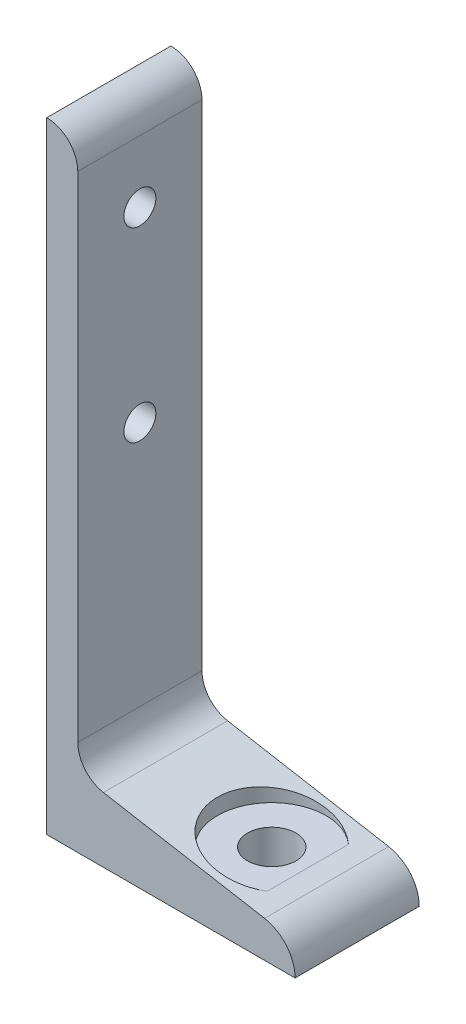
ISO-10303-21;
HEADER;
FILE_DESCRIPTION(('STEP AP214'),'2;1');
FILE_NAME('part.step','',(''),(''),'','','');
FILE_SCHEMA(('AUTOMOTIVE_DESIGN { 1 0 10303 214 1 1 1 1 }'));
ENDSEC;
DATA;
#1=APPLICATION_CONTEXT('core data for automotive mechanical design processes');
#2=APPLICATION_PROTOCOL_DEFINITION('international standard','automotive_design',2000,#1);
#3=PRODUCT_CONTEXT('',#1,'mechanical');
#4=PRODUCT('Part','Part','',(#3));
#5=PRODUCT_RELATED_PRODUCT_CATEGORY('part','',(#4));
#6=PRODUCT_DEFINITION_FORMATION('','',#4);
#7=PRODUCT_DEFINITION_CONTEXT('part definition',#1,'design');
#8=PRODUCT_DEFINITION('design','',#6,#7);
#9=PRODUCT_DEFINITION_SHAPE('','',#8);
#10=(LENGTH_UNIT() NAMED_UNIT(*) SI_UNIT(.MILLI.,.METRE.));
#11=(NAMED_UNIT(*) PLANE_ANGLE_UNIT() SI_UNIT($,.RADIAN.));
#12=(NAMED_UNIT(*) SI_UNIT($,.STERADIAN.) SOLID_ANGLE_UNIT());
#13=UNCERTAINTY_MEASURE_WITH_UNIT(LENGTH_MEASURE(1.E-05),#10,'distance_accuracy_value','');
#14=(GEOMETRIC_REPRESENTATION_CONTEXT(3) GLOBAL_UNCERTAINTY_ASSIGNED_CONTEXT((#13)) GLOBAL_UNIT_ASSIGNED_CONTEXT((#10,
#11,#12)) REPRESENTATION_CONTEXT('',''));
#15=CARTESIAN_POINT('',(0.,0.,0.));
#16=DIRECTION('',(0.,0.,1.));
#17=DIRECTION('',(1.,0.,0.));
#18=AXIS2_PLACEMENT_3D('',#15,#16,#17);
#19=CARTESIAN_POINT('',(6.34999999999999,120.65,12.7));
#20=DIRECTION('',(-1.,0.,0.));
#21=DIRECTION('',(0.,-1.,0.));
#22=AXIS2_PLACEMENT_3D('',#19,#20,#21);
#23=PLANE('',#22);
#24=CARTESIAN_POINT('',(6.35,69.85,0.));
#25=DIRECTION('',(-1.,0.,0.));
#26=DIRECTION('',(0.,-1.,0.));
#27=AXIS2_PLACEMENT_3D('',#24,#25,#26);
#28=CIRCLE('',#27,3.2639);
#29=CARTESIAN_POINT('',(6.35,66.5861,0.));
#30=VERTEX_POINT('',#29);
#31=EDGE_CURVE('E164',#30,#30,#28,.F.);
#32=ORIENTED_EDGE('',*,*,#31,.F.);
#33=EDGE_LOOP('',(#32));
#34=FACE_BOUND('',#33,.T.);
#35=DIRECTION('',(0.,1.,0.));
#36=VECTOR('',#35,1.);
#37=CARTESIAN_POINT('',(6.34999999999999,120.65,-12.7));
#38=LINE('',#37,#36);
#39=CARTESIAN_POINT('',(6.35000000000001,19.5160169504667,-12.7));
#40=VERTEX_POINT('',#39);
#41=CARTESIAN_POINT('',(6.34999999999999,120.65,-12.7));
#42=VERTEX_POINT('',#41);
#43=EDGE_CURVE('E122',#40,#42,#38,.T.);
#44=ORIENTED_EDGE('',*,*,#43,.T.);
#45=DIRECTION('',(0.,0.,-1.));
#46=VECTOR('',#45,1.);
#47=CARTESIAN_POINT('',(6.34999999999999,120.65,12.7));
#48=LINE('',#47,#46);
#49=CARTESIAN_POINT('',(6.34999999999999,120.65,12.7));
#50=VERTEX_POINT('',#49);
#51=EDGE_CURVE('E119',#50,#42,#48,.T.);
#52=ORIENTED_EDGE('',*,*,#51,.F.);
#53=DIRECTION('',(0.,1.,0.));
#54=VECTOR('',#53,1.);
#55=CARTESIAN_POINT('',(6.34999999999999,120.65,12.7));
#56=LINE('',#55,#54);
#57=CARTESIAN_POINT('',(6.35000000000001,19.5160169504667,12.7));
#58=VERTEX_POINT('',#57);
#59=EDGE_CURVE('E106',#58,#50,#56,.T.);
#60=ORIENTED_EDGE('',*,*,#59,.F.);
#61=DIRECTION('',(0.,0.,-1.));
#62=VECTOR('',#61,1.);
#63=CARTESIAN_POINT('',(6.35000000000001,19.5160169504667,12.7));
#64=LINE('',#63,#62);
#65=EDGE_CURVE('E125',#58,#40,#64,.T.);
#66=ORIENTED_EDGE('',*,*,#65,.T.);
#67=EDGE_LOOP('',(#44,#52,#60,#66));
#68=FACE_BOUND('',#67,.T.);
#69=CARTESIAN_POINT('',(6.34999999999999,107.95,0.));
#70=DIRECTION('',(-1.,0.,0.));
#71=DIRECTION('',(0.,-1.,0.));
#72=AXIS2_PLACEMENT_3D('',#69,#70,#71);
#73=CIRCLE('',#72,3.2639);
#74=CARTESIAN_POINT('',(6.34999999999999,104.6861,0.));
#75=VERTEX_POINT('',#74);
#76=EDGE_CURVE('E258',#75,#75,#73,.F.);
#77=ORIENTED_EDGE('',*,*,#76,.F.);
#78=EDGE_LOOP('',(#77));
#79=FACE_BOUND('',#78,.T.);
#80=ADVANCED_FACE('F34',(#34,#68,#79),#23,.F.);
#81=CARTESIAN_POINT('',(0.,0.,12.7));
#82=DIRECTION('',(1.,0.,0.));
#83=DIRECTION('',(0.,0.,-1.));
#84=AXIS2_PLACEMENT_3D('',#81,#82,#83);
#85=PLANE('',#84);
#86=CARTESIAN_POINT('',(0.,69.85,0.));
#87=DIRECTION('',(1.,0.,0.));
#88=DIRECTION('',(0.,0.,-1.));
#89=AXIS2_PLACEMENT_3D('',#86,#87,#88);
#90=CIRCLE('',#89,3.2639);
#91=CARTESIAN_POINT('',(0.,69.85,-3.2639));
#92=VERTEX_POINT('',#91);
#93=EDGE_CURVE('E167',#92,#92,#90,.T.);
#94=ORIENTED_EDGE('',*,*,#93,.T.);
#95=EDGE_LOOP('',(#94));
#96=FACE_BOUND('',#95,.T.);
#97=DIRECTION('',(0.,-1.,0.));
#98=VECTOR('',#97,1.);
#99=CARTESIAN_POINT('',(0.,0.,-12.7));
#100=LINE('',#99,#98);
#101=CARTESIAN_POINT('',(0.,127.,-12.7));
#102=VERTEX_POINT('',#101);
#103=CARTESIAN_POINT('',(0.,0.,-12.7));
#104=VERTEX_POINT('',#103);
#105=EDGE_CURVE('E86',#102,#104,#100,.T.);
#106=ORIENTED_EDGE('',*,*,#105,.T.);
#107=DIRECTION('',(0.,0.,-1.));
#108=VECTOR('',#107,1.);
#109=CARTESIAN_POINT('',(0.,0.,12.7));
#110=LINE('',#109,#108);
#111=CARTESIAN_POINT('',(0.,0.,12.7));
#112=VERTEX_POINT('',#111);
#113=EDGE_CURVE('E130',#112,#104,#110,.T.);
#114=ORIENTED_EDGE('',*,*,#113,.F.);
#115=DIRECTION('',(0.,-1.,0.));
#116=VECTOR('',#115,1.);
#117=CARTESIAN_POINT('',(0.,0.,12.7));
#118=LINE('',#117,#116);
#119=CARTESIAN_POINT('',(0.,127.,12.7));
#120=VERTEX_POINT('',#119);
#121=EDGE_CURVE('E56',#120,#112,#118,.T.);
#122=ORIENTED_EDGE('',*,*,#121,.F.);
#123=DIRECTION('',(0.,0.,-1.));
#124=VECTOR('',#123,1.);
#125=CARTESIAN_POINT('',(0.,127.,12.7));
#126=LINE('',#125,#124);
#127=EDGE_CURVE('E126',#120,#102,#126,.T.);
#128=ORIENTED_EDGE('',*,*,#127,.T.);
#129=EDGE_LOOP('',(#106,#114,#122,#128));
#130=FACE_BOUND('',#129,.T.);
#131=CARTESIAN_POINT('',(0.,107.95,0.));
#132=DIRECTION('',(1.,0.,0.));
#133=DIRECTION('',(0.,0.,-1.));
#134=AXIS2_PLACEMENT_3D('',#131,#132,#133);
#135=CIRCLE('',#134,3.2639);
#136=CARTESIAN_POINT('',(0.,107.95,-3.2639));
#137=VERTEX_POINT('',#136);
#138=EDGE_CURVE('E255',#137,#137,#135,.T.);
#139=ORIENTED_EDGE('',*,*,#138,.T.);
#140=EDGE_LOOP('',(#139));
#141=FACE_BOUND('',#140,.T.);
#142=ADVANCED_FACE('F188',(#96,#130,#141),#85,.F.);
#143=CARTESIAN_POINT('',(11.597334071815,13.2624877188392,12.7));
#144=DIRECTION('',(-0.173648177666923,-0.984807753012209,0.));
#145=DIRECTION('',(0.984807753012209,-0.173648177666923,0.));
#146=AXIS2_PLACEMENT_3D('',#143,#144,#145);
#147=PLANE('',#146);
#148=DIRECTION('',(-0.984807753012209,0.173648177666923,0.));
#149=VECTOR('',#148,1.);
#150=CARTESIAN_POINT('',(11.597334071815,13.2624877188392,-12.7));
#151=LINE('',#150,#149);
#152=CARTESIAN_POINT('',(44.5464707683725,7.45266592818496,-12.7));
#153=VERTEX_POINT('',#152);
#154=CARTESIAN_POINT('',(11.597334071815,13.2624877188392,-12.7));
#155=VERTEX_POINT('',#154);
#156=EDGE_CURVE('E140',#153,#155,#151,.T.);
#157=ORIENTED_EDGE('',*,*,#156,.T.);
#158=DIRECTION('',(0.,0.,-1.));
#159=VECTOR('',#158,1.);
#160=CARTESIAN_POINT('',(11.597334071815,13.2624877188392,12.7));
#161=LINE('',#160,#159);
#162=CARTESIAN_POINT('',(11.597334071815,13.2624877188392,12.7));
#163=VERTEX_POINT('',#162);
#164=EDGE_CURVE('E152',#163,#155,#161,.T.);
#165=ORIENTED_EDGE('',*,*,#164,.F.);
#166=DIRECTION('',(-0.984807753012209,0.173648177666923,0.));
#167=VECTOR('',#166,1.);
#168=CARTESIAN_POINT('',(11.597334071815,13.2624877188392,12.7));
#169=LINE('',#168,#167);
#170=CARTESIAN_POINT('',(44.5464707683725,7.45266592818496,12.7));
#171=VERTEX_POINT('',#170);
#172=EDGE_CURVE('E175',#171,#163,#169,.T.);
#173=ORIENTED_EDGE('',*,*,#172,.F.);
#174=DIRECTION('',(0.,0.,-1.));
#175=VECTOR('',#174,1.);
#176=CARTESIAN_POINT('',(44.5464707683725,7.45266592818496,12.7));
#177=LINE('',#176,#175);
#178=EDGE_CURVE('E155',#171,#153,#177,.T.);
#179=ORIENTED_EDGE('',*,*,#178,.T.);
#180=EDGE_LOOP('',(#157,#165,#173,#179));
#181=FACE_BOUND('',#180,.T.);
#182=CARTESIAN_POINT('',(33.3248,9.43134925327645,0.));
#183=DIRECTION('',(-0.173648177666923,-0.984807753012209,0.));
#184=DIRECTION('',(0.984807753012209,-0.173648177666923,0.));
#185=AXIS2_PLACEMENT_3D('',#182,#183,#184);
#186=ELLIPSE('',#185,11.2839282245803,11.1125);
#187=CARTESIAN_POINT('',(40.7164609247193,8.128,-8.29765057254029));
#188=VERTEX_POINT('',#187);
#189=CARTESIAN_POINT('',(40.7164609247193,8.128,8.29765057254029));
#190=VERTEX_POINT('',#189);
#191=EDGE_CURVE('E11',#188,#190,#186,.F.);
#192=ORIENTED_EDGE('',*,*,#191,.F.);
#193=DIRECTION('',(0.,0.,-1.));
#194=VECTOR('',#193,1.);
#195=CARTESIAN_POINT('',(40.7164609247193,8.128,12.7));
#196=LINE('',#195,#194);
#197=EDGE_CURVE('E160',#190,#188,#196,.T.);
#198=ORIENTED_EDGE('',*,*,#197,.F.);
#199=EDGE_LOOP('',(#192,#198));
#200=FACE_BOUND('',#199,.T.);
#201=ADVANCED_FACE('F179',(#181,#200),#147,.F.);
#202=CARTESIAN_POINT('',(33.3248,127.,0.));
#203=DIRECTION('',(0.,-1.,0.));
#204=DIRECTION('',(0.,0.,-1.));
#205=AXIS2_PLACEMENT_3D('',#202,#203,#204);
#206=CYLINDRICAL_SURFACE('',#205,4.95299999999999);
#207=CARTESIAN_POINT('',(33.3248,0.,0.));
#208=DIRECTION('',(0.,1.,0.));
#209=DIRECTION('',(0.,0.,1.));
#210=AXIS2_PLACEMENT_3D('',#207,#208,#209);
#211=CIRCLE('',#210,4.95299999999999);
#212=CARTESIAN_POINT('',(33.3248,0.,4.95299999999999));
#213=VERTEX_POINT('',#212);
#214=EDGE_CURVE('E138',#213,#213,#211,.T.);
#215=ORIENTED_EDGE('',*,*,#214,.F.);
#216=EDGE_LOOP('',(#215));
#217=FACE_BOUND('',#216,.T.);
#218=CARTESIAN_POINT('',(33.3248,8.128,0.));
#219=DIRECTION('',(0.,1.,0.));
#220=DIRECTION('',(0.,0.,1.));
#221=AXIS2_PLACEMENT_3D('',#218,#219,#220);
#222=CIRCLE('',#221,4.95299999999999);
#223=CARTESIAN_POINT('',(33.3248,8.128,4.95299999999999));
#224=VERTEX_POINT('',#223);
#225=EDGE_CURVE('E158',#224,#224,#222,.T.);
#226=ORIENTED_EDGE('',*,*,#225,.T.);
#227=EDGE_LOOP('',(#226));
#228=FACE_BOUND('',#227,.T.);
#229=ADVANCED_FACE('F201',(#217,#228),#206,.F.);
#230=CARTESIAN_POINT('',(50.8,0.,12.7));
#231=DIRECTION('',(0.,1.,0.));
#232=DIRECTION('',(-1.,0.,0.));
#233=AXIS2_PLACEMENT_3D('',#230,#231,#232);
#234=PLANE('',#233);
#235=DIRECTION('',(1.,0.,0.));
#236=VECTOR('',#235,1.);
#237=CARTESIAN_POINT('',(50.8,0.,-12.7));
#238=LINE('',#237,#236);
#239=CARTESIAN_POINT('',(50.8,0.,-12.7));
#240=VERTEX_POINT('',#239);
#241=EDGE_CURVE('E134',#104,#240,#238,.T.);
#242=ORIENTED_EDGE('',*,*,#241,.T.);
#243=DIRECTION('',(0.,0.,-1.));
#244=VECTOR('',#243,1.);
#245=CARTESIAN_POINT('',(50.8,0.,12.7));
#246=LINE('',#245,#244);
#247=CARTESIAN_POINT('',(50.8,0.,12.7));
#248=VERTEX_POINT('',#247);
#249=EDGE_CURVE('E42',#248,#240,#246,.T.);
#250=ORIENTED_EDGE('',*,*,#249,.F.);
#251=DIRECTION('',(1.,0.,0.));
#252=VECTOR('',#251,1.);
#253=CARTESIAN_POINT('',(50.8,0.,12.7));
#254=LINE('',#253,#252);
#255=EDGE_CURVE('E148',#112,#248,#254,.T.);
#256=ORIENTED_EDGE('',*,*,#255,.F.);
#257=ORIENTED_EDGE('',*,*,#113,.T.);
#258=EDGE_LOOP('',(#242,#250,#256,#257));
#259=FACE_BOUND('',#258,.T.);
#260=ORIENTED_EDGE('',*,*,#214,.T.);
#261=EDGE_LOOP('',(#260));
#262=FACE_BOUND('',#261,.T.);
#263=ADVANCED_FACE('F36',(#259,#262),#234,.F.);
#264=CARTESIAN_POINT('',(43.2323646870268,0.,12.7));
#265=DIRECTION('',(0.,0.,-1.));
#266=DIRECTION('',(-1.,0.,0.));
#267=AXIS2_PLACEMENT_3D('',#264,#265,#266);
#268=CYLINDRICAL_SURFACE('',#267,7.56763531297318);
#269=CARTESIAN_POINT('',(43.2323646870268,0.,-12.7));
#270=DIRECTION('',(0.,0.,1.));
#271=DIRECTION('',(1.,0.,0.));
#272=AXIS2_PLACEMENT_3D('',#269,#270,#271);
#273=CIRCLE('',#272,7.56763531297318);
#274=EDGE_CURVE('E137',#240,#153,#273,.T.);
#275=ORIENTED_EDGE('',*,*,#274,.T.);
#276=ORIENTED_EDGE('',*,*,#178,.F.);
#277=CARTESIAN_POINT('',(43.2323646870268,0.,12.7));
#278=DIRECTION('',(0.,0.,1.));
#279=DIRECTION('',(1.,0.,0.));
#280=AXIS2_PLACEMENT_3D('',#277,#278,#279);
#281=CIRCLE('',#280,7.56763531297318);
#282=EDGE_CURVE('E95',#248,#171,#281,.T.);
#283=ORIENTED_EDGE('',*,*,#282,.F.);
#284=ORIENTED_EDGE('',*,*,#249,.T.);
#285=EDGE_LOOP('',(#275,#276,#283,#284));
#286=FACE_BOUND('',#285,.T.);
#287=ADVANCED_FACE('F194',(#286),#268,.T.);
#288=CARTESIAN_POINT('',(12.7,19.5160169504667,12.7));
#289=DIRECTION('',(0.,0.,-1.));
#290=DIRECTION('',(-1.,0.,0.));
#291=AXIS2_PLACEMENT_3D('',#288,#289,#290);
#292=CYLINDRICAL_SURFACE('',#291,6.35);
#293=CARTESIAN_POINT('',(12.7,19.5160169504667,-12.7));
#294=DIRECTION('',(0.,0.,-1.));
#295=DIRECTION('',(1.,0.,0.));
#296=AXIS2_PLACEMENT_3D('',#293,#294,#295);
#297=CIRCLE('',#296,6.35);
#298=EDGE_CURVE('E142',#155,#40,#297,.T.);
#299=ORIENTED_EDGE('',*,*,#298,.T.);
#300=ORIENTED_EDGE('',*,*,#65,.F.);
#301=CARTESIAN_POINT('',(12.7,19.5160169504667,12.7));
#302=DIRECTION('',(0.,0.,-1.));
#303=DIRECTION('',(1.,0.,0.));
#304=AXIS2_PLACEMENT_3D('',#301,#302,#303);
#305=CIRCLE('',#304,6.35);
#306=EDGE_CURVE('E113',#163,#58,#305,.T.);
#307=ORIENTED_EDGE('',*,*,#306,.F.);
#308=ORIENTED_EDGE('',*,*,#164,.T.);
#309=EDGE_LOOP('',(#299,#300,#307,#308));
#310=FACE_BOUND('',#309,.T.);
#311=ADVANCED_FACE('F184',(#310),#292,.F.);
#312=CARTESIAN_POINT('',(0.,120.65,12.7));
#313=DIRECTION('',(0.,0.,-1.));
#314=DIRECTION('',(-1.,0.,0.));
#315=AXIS2_PLACEMENT_3D('',#312,#313,#314);
#316=CYLINDRICAL_SURFACE('',#315,6.34999999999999);
#317=CARTESIAN_POINT('',(0.,120.65,-12.7));
#318=DIRECTION('',(0.,0.,1.));
#319=DIRECTION('',(1.,0.,0.));
#320=AXIS2_PLACEMENT_3D('',#317,#318,#319);
#321=CIRCLE('',#320,6.34999999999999);
#322=EDGE_CURVE('E145',#42,#102,#321,.T.);
#323=ORIENTED_EDGE('',*,*,#322,.T.);
#324=ORIENTED_EDGE('',*,*,#127,.F.);
#325=CARTESIAN_POINT('',(0.,120.65,12.7));
#326=DIRECTION('',(0.,0.,1.));
#327=DIRECTION('',(1.,0.,0.));
#328=AXIS2_PLACEMENT_3D('',#325,#326,#327);
#329=CIRCLE('',#328,6.34999999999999);
#330=EDGE_CURVE('E110',#50,#120,#329,.T.);
#331=ORIENTED_EDGE('',*,*,#330,.F.);
#332=ORIENTED_EDGE('',*,*,#51,.T.);
#333=EDGE_LOOP('',(#323,#324,#331,#332));
#334=FACE_BOUND('',#333,.T.);
#335=ADVANCED_FACE('F128',(#334),#316,.T.);
#336=CARTESIAN_POINT('',(0.,120.65,12.7));
#337=DIRECTION('',(0.,0.,1.));
#338=DIRECTION('',(1.,0.,0.));
#339=AXIS2_PLACEMENT_3D('',#336,#337,#338);
#340=PLANE('',#339);
#341=ORIENTED_EDGE('',*,*,#255,.T.);
#342=ORIENTED_EDGE('',*,*,#282,.T.);
#343=ORIENTED_EDGE('',*,*,#172,.T.);
#344=ORIENTED_EDGE('',*,*,#306,.T.);
#345=ORIENTED_EDGE('',*,*,#59,.T.);
#346=ORIENTED_EDGE('',*,*,#330,.T.);
#347=ORIENTED_EDGE('',*,*,#121,.T.);
#348=EDGE_LOOP('',(#341,#342,#343,#344,#345,#346,#347));
#349=FACE_BOUND('',#348,.T.);
#350=ADVANCED_FACE('F108',(#349),#340,.T.);
#351=CARTESIAN_POINT('',(0.,120.65,-12.7));
#352=DIRECTION('',(0.,0.,1.));
#353=DIRECTION('',(1.,0.,0.));
#354=AXIS2_PLACEMENT_3D('',#351,#352,#353);
#355=PLANE('',#354);
#356=ORIENTED_EDGE('',*,*,#241,.F.);
#357=ORIENTED_EDGE('',*,*,#105,.F.);
#358=ORIENTED_EDGE('',*,*,#322,.F.);
#359=ORIENTED_EDGE('',*,*,#43,.F.);
#360=ORIENTED_EDGE('',*,*,#298,.F.);
#361=ORIENTED_EDGE('',*,*,#156,.F.);
#362=ORIENTED_EDGE('',*,*,#274,.F.);
#363=EDGE_LOOP('',(#356,#357,#358,#359,#360,#361,#362));
#364=FACE_BOUND('',#363,.T.);
#365=ADVANCED_FACE('F187',(#364),#355,.F.);
#366=CARTESIAN_POINT('',(33.3248,127.,0.));
#367=DIRECTION('',(0.,-1.,0.));
#368=DIRECTION('',(0.,0.,-1.));
#369=AXIS2_PLACEMENT_3D('',#366,#367,#368);
#370=CYLINDRICAL_SURFACE('',#369,11.1125);
#371=ORIENTED_EDGE('',*,*,#191,.T.);
#372=CARTESIAN_POINT('',(33.3248,8.128,0.));
#373=DIRECTION('',(0.,1.,0.));
#374=DIRECTION('',(0.,0.,1.));
#375=AXIS2_PLACEMENT_3D('',#372,#373,#374);
#376=CIRCLE('',#375,11.1125);
#377=EDGE_CURVE('E48',#188,#190,#376,.T.);
#378=ORIENTED_EDGE('',*,*,#377,.F.);
#379=EDGE_LOOP('',(#371,#378));
#380=FACE_BOUND('',#379,.T.);
#381=ADVANCED_FACE('F224',(#380),#370,.F.);
#382=CARTESIAN_POINT('',(33.3248,8.128,0.));
#383=DIRECTION('',(0.,1.,0.));
#384=DIRECTION('',(0.,0.,1.));
#385=AXIS2_PLACEMENT_3D('',#382,#383,#384);
#386=PLANE('',#385);
#387=ORIENTED_EDGE('',*,*,#225,.F.);
#388=EDGE_LOOP('',(#387));
#389=FACE_BOUND('',#388,.T.);
#390=ORIENTED_EDGE('',*,*,#197,.T.);
#391=ORIENTED_EDGE('',*,*,#377,.T.);
#392=EDGE_LOOP('',(#390,#391));
#393=FACE_BOUND('',#392,.T.);
#394=ADVANCED_FACE('F232',(#389,#393),#386,.T.);
#395=CARTESIAN_POINT('',(50.8,69.85,0.));
#396=DIRECTION('',(-1.,0.,0.));
#397=DIRECTION('',(0.,0.,1.));
#398=AXIS2_PLACEMENT_3D('',#395,#396,#397);
#399=CYLINDRICAL_SURFACE('',#398,3.2639);
#400=ORIENTED_EDGE('',*,*,#93,.F.);
#401=EDGE_LOOP('',(#400));
#402=FACE_BOUND('',#401,.T.);
#403=ORIENTED_EDGE('',*,*,#31,.T.);
#404=EDGE_LOOP('',(#403));
#405=FACE_BOUND('',#404,.T.);
#406=ADVANCED_FACE('F237',(#402,#405),#399,.F.);
#407=CARTESIAN_POINT('',(50.8,107.95,0.));
#408=DIRECTION('',(-1.,0.,0.));
#409=DIRECTION('',(0.,0.,1.));
#410=AXIS2_PLACEMENT_3D('',#407,#408,#409);
#411=CYLINDRICAL_SURFACE('',#410,3.2639);
#412=ORIENTED_EDGE('',*,*,#138,.F.);
#413=EDGE_LOOP('',(#412));
#414=FACE_BOUND('',#413,.T.);
#415=ORIENTED_EDGE('',*,*,#76,.T.);
#416=EDGE_LOOP('',(#415));
#417=FACE_BOUND('',#416,.T.);
#418=ADVANCED_FACE('F244',(#414,#417),#411,.F.);
#419=CLOSED_SHELL('',(#80,#142,#201,#229,#263,#287,#311,#335,#350,#365,#381,#394,#406,#418));
#420=MANIFOLD_SOLID_BREP('B2',#419);
#421=ADVANCED_BREP_SHAPE_REPRESENTATION('',(#18,#420),#14);
#422=SHAPE_DEFINITION_REPRESENTATION(#9,#421);
ENDSEC;
END-ISO-10303-21;
